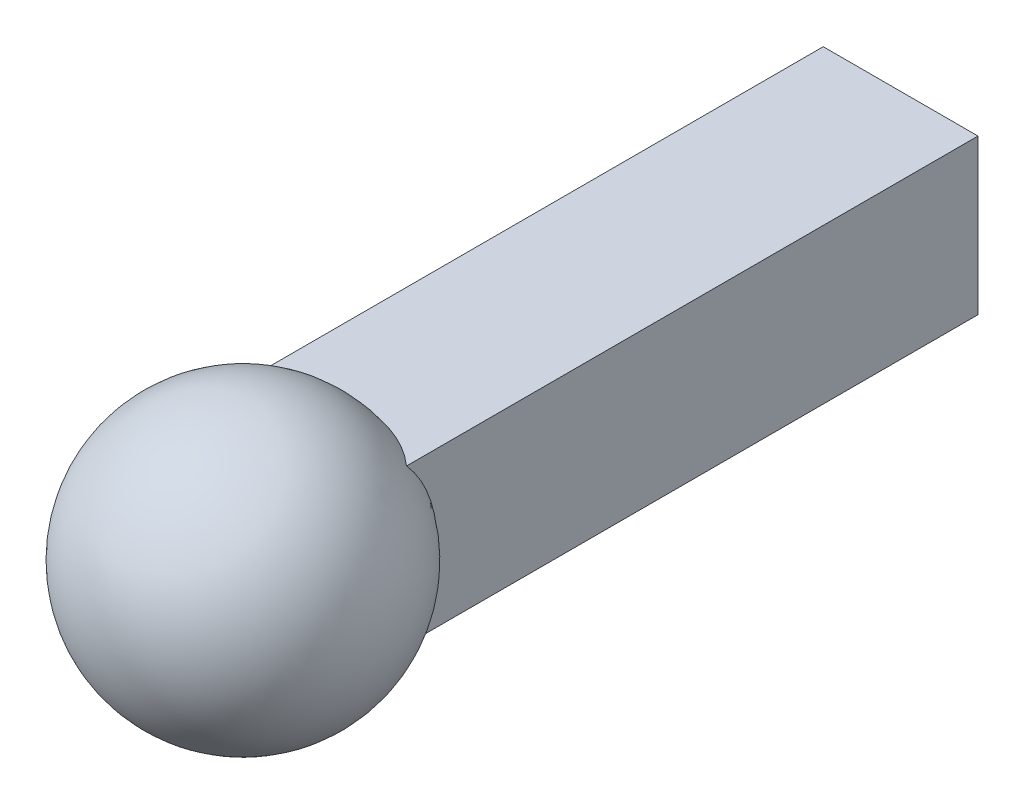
from build123d import *

# Parameters (mm, degrees)
CROQUIS9_W              = 10
CROQUIS9_H              = 10
SALIENTE_EXTRUIR5_DEPTH = 42.5


with BuildPart() as part:
    # Croquis6 → Revoluci_n19 (revolve)
    with BuildSketch(Plane(origin=(0, 0, 0), x_dir=(0, 0, -1), z_dir=(1, 0, 0))):
        with BuildLine():
            Line((0, 9), (0, -9))
            ThreePointArc((0, -9), (9, 0), (0, 9))
        make_face()
    revolve(axis=Axis((0, 9, 0), (0, -1, 0)))

    # Croquis9 → Saliente-Extruir5 (add)
    with BuildSketch(Plane.XY):
        Rectangle(CROQUIS9_W, CROQUIS9_H)
    extrude(amount=-SALIENTE_EXTRUIR5_DEPTH)


solid = part.part
